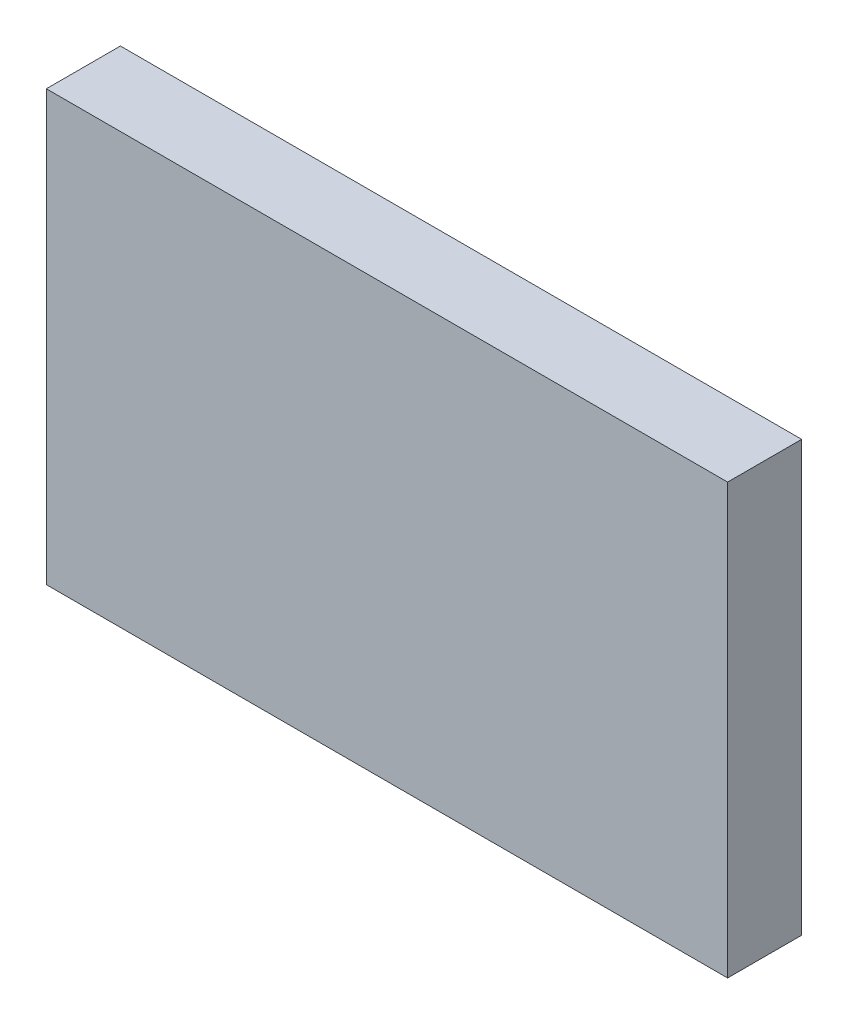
ISO-10303-21;
HEADER;
FILE_DESCRIPTION(('STEP AP214'),'2;1');
FILE_NAME('part.step','',(''),(''),'','','');
FILE_SCHEMA(('AUTOMOTIVE_DESIGN { 1 0 10303 214 1 1 1 1 }'));
ENDSEC;
DATA;
#1=APPLICATION_CONTEXT('core data for automotive mechanical design processes');
#2=APPLICATION_PROTOCOL_DEFINITION('international standard','automotive_design',2000,#1);
#3=PRODUCT_CONTEXT('',#1,'mechanical');
#4=PRODUCT('Part','Part','',(#3));
#5=PRODUCT_RELATED_PRODUCT_CATEGORY('part','',(#4));
#6=PRODUCT_DEFINITION_FORMATION('','',#4);
#7=PRODUCT_DEFINITION_CONTEXT('part definition',#1,'design');
#8=PRODUCT_DEFINITION('design','',#6,#7);
#9=PRODUCT_DEFINITION_SHAPE('','',#8);
#10=(LENGTH_UNIT() NAMED_UNIT(*) SI_UNIT(.MILLI.,.METRE.));
#11=(NAMED_UNIT(*) PLANE_ANGLE_UNIT() SI_UNIT($,.RADIAN.));
#12=(NAMED_UNIT(*) SI_UNIT($,.STERADIAN.) SOLID_ANGLE_UNIT());
#13=UNCERTAINTY_MEASURE_WITH_UNIT(LENGTH_MEASURE(1.E-05),#10,'distance_accuracy_value','');
#14=(GEOMETRIC_REPRESENTATION_CONTEXT(3) GLOBAL_UNCERTAINTY_ASSIGNED_CONTEXT((#13)) GLOBAL_UNIT_ASSIGNED_CONTEXT((#10,
#11,#12)) REPRESENTATION_CONTEXT('',''));
#15=CARTESIAN_POINT('',(0.,0.,0.));
#16=DIRECTION('',(0.,0.,1.));
#17=DIRECTION('',(1.,0.,0.));
#18=AXIS2_PLACEMENT_3D('',#15,#16,#17);
#19=CARTESIAN_POINT('',(-115.,-72.5,25.));
#20=DIRECTION('',(0.,1.,0.));
#21=DIRECTION('',(0.,0.,1.));
#22=AXIS2_PLACEMENT_3D('',#19,#20,#21);
#23=PLANE('',#22);
#24=DIRECTION('',(1.,0.,0.));
#25=VECTOR('',#24,1.);
#26=CARTESIAN_POINT('',(-115.,-72.5,0.));
#27=LINE('',#26,#25);
#28=CARTESIAN_POINT('',(-115.,-72.5,0.));
#29=VERTEX_POINT('',#28);
#30=CARTESIAN_POINT('',(115.,-72.5,0.));
#31=VERTEX_POINT('',#30);
#32=EDGE_CURVE('E108',#29,#31,#27,.T.);
#33=ORIENTED_EDGE('',*,*,#32,.T.);
#34=DIRECTION('',(0.,0.,-1.));
#35=VECTOR('',#34,1.);
#36=CARTESIAN_POINT('',(115.,-72.5,25.));
#37=LINE('',#36,#35);
#38=CARTESIAN_POINT('',(115.,-72.5,25.));
#39=VERTEX_POINT('',#38);
#40=EDGE_CURVE('E12',#39,#31,#37,.T.);
#41=ORIENTED_EDGE('',*,*,#40,.F.);
#42=DIRECTION('',(1.,0.,0.));
#43=VECTOR('',#42,1.);
#44=CARTESIAN_POINT('',(-115.,-72.5,25.));
#45=LINE('',#44,#43);
#46=CARTESIAN_POINT('',(-115.,-72.5,25.));
#47=VERTEX_POINT('',#46);
#48=EDGE_CURVE('E94',#47,#39,#45,.T.);
#49=ORIENTED_EDGE('',*,*,#48,.F.);
#50=DIRECTION('',(0.,0.,-1.));
#51=VECTOR('',#50,1.);
#52=CARTESIAN_POINT('',(-115.,-72.5,25.));
#53=LINE('',#52,#51);
#54=EDGE_CURVE('E61',#47,#29,#53,.T.);
#55=ORIENTED_EDGE('',*,*,#54,.T.);
#56=EDGE_LOOP('',(#33,#41,#49,#55));
#57=FACE_BOUND('',#56,.T.);
#58=ADVANCED_FACE('F45',(#57),#23,.F.);
#59=CARTESIAN_POINT('',(115.,-72.5,25.));
#60=DIRECTION('',(-1.,0.,0.));
#61=DIRECTION('',(0.,0.,1.));
#62=AXIS2_PLACEMENT_3D('',#59,#60,#61);
#63=PLANE('',#62);
#64=DIRECTION('',(0.,1.,0.));
#65=VECTOR('',#64,1.);
#66=CARTESIAN_POINT('',(115.,-72.5,0.));
#67=LINE('',#66,#65);
#68=CARTESIAN_POINT('',(115.,72.5,0.));
#69=VERTEX_POINT('',#68);
#70=EDGE_CURVE('E99',#31,#69,#67,.T.);
#71=ORIENTED_EDGE('',*,*,#70,.T.);
#72=DIRECTION('',(0.,0.,-1.));
#73=VECTOR('',#72,1.);
#74=CARTESIAN_POINT('',(115.,72.5,25.));
#75=LINE('',#74,#73);
#76=CARTESIAN_POINT('',(115.,72.5,25.));
#77=VERTEX_POINT('',#76);
#78=EDGE_CURVE('E53',#77,#69,#75,.T.);
#79=ORIENTED_EDGE('',*,*,#78,.F.);
#80=DIRECTION('',(0.,1.,0.));
#81=VECTOR('',#80,1.);
#82=CARTESIAN_POINT('',(115.,-72.5,25.));
#83=LINE('',#82,#81);
#84=EDGE_CURVE('E86',#39,#77,#83,.T.);
#85=ORIENTED_EDGE('',*,*,#84,.F.);
#86=ORIENTED_EDGE('',*,*,#40,.T.);
#87=EDGE_LOOP('',(#71,#79,#85,#86));
#88=FACE_BOUND('',#87,.T.);
#89=ADVANCED_FACE('F98',(#88),#63,.F.);
#90=CARTESIAN_POINT('',(-115.,72.5,25.));
#91=DIRECTION('',(0.,1.,0.));
#92=DIRECTION('',(0.,0.,1.));
#93=AXIS2_PLACEMENT_3D('',#90,#91,#92);
#94=PLANE('',#93);
#95=DIRECTION('',(1.,0.,0.));
#96=VECTOR('',#95,1.);
#97=CARTESIAN_POINT('',(-115.,72.5,0.));
#98=LINE('',#97,#96);
#99=CARTESIAN_POINT('',(-115.,72.5,0.));
#100=VERTEX_POINT('',#99);
#101=EDGE_CURVE('E111',#100,#69,#98,.T.);
#102=ORIENTED_EDGE('',*,*,#101,.F.);
#103=DIRECTION('',(0.,0.,-1.));
#104=VECTOR('',#103,1.);
#105=CARTESIAN_POINT('',(-115.,72.5,25.));
#106=LINE('',#105,#104);
#107=CARTESIAN_POINT('',(-115.,72.5,25.));
#108=VERTEX_POINT('',#107);
#109=EDGE_CURVE('E75',#108,#100,#106,.T.);
#110=ORIENTED_EDGE('',*,*,#109,.F.);
#111=DIRECTION('',(1.,0.,0.));
#112=VECTOR('',#111,1.);
#113=CARTESIAN_POINT('',(-115.,72.5,25.));
#114=LINE('',#113,#112);
#115=EDGE_CURVE('E93',#108,#77,#114,.T.);
#116=ORIENTED_EDGE('',*,*,#115,.T.);
#117=ORIENTED_EDGE('',*,*,#78,.T.);
#118=EDGE_LOOP('',(#102,#110,#116,#117));
#119=FACE_BOUND('',#118,.T.);
#120=ADVANCED_FACE('F102',(#119),#94,.T.);
#121=CARTESIAN_POINT('',(-115.,-72.5,25.));
#122=DIRECTION('',(-1.,0.,0.));
#123=DIRECTION('',(0.,0.,1.));
#124=AXIS2_PLACEMENT_3D('',#121,#122,#123);
#125=PLANE('',#124);
#126=DIRECTION('',(0.,1.,0.));
#127=VECTOR('',#126,1.);
#128=CARTESIAN_POINT('',(-115.,-72.5,0.));
#129=LINE('',#128,#127);
#130=EDGE_CURVE('E113',#29,#100,#129,.T.);
#131=ORIENTED_EDGE('',*,*,#130,.F.);
#132=ORIENTED_EDGE('',*,*,#54,.F.);
#133=DIRECTION('',(0.,1.,0.));
#134=VECTOR('',#133,1.);
#135=CARTESIAN_POINT('',(-115.,-72.5,25.));
#136=LINE('',#135,#134);
#137=EDGE_CURVE('E103',#47,#108,#136,.T.);
#138=ORIENTED_EDGE('',*,*,#137,.T.);
#139=ORIENTED_EDGE('',*,*,#109,.T.);
#140=EDGE_LOOP('',(#131,#132,#138,#139));
#141=FACE_BOUND('',#140,.T.);
#142=ADVANCED_FACE('F119',(#141),#125,.T.);
#143=CARTESIAN_POINT('',(0.,0.,25.));
#144=DIRECTION('',(0.,0.,1.));
#145=DIRECTION('',(1.,0.,0.));
#146=AXIS2_PLACEMENT_3D('',#143,#144,#145);
#147=PLANE('',#146);
#148=ORIENTED_EDGE('',*,*,#48,.T.);
#149=ORIENTED_EDGE('',*,*,#84,.T.);
#150=ORIENTED_EDGE('',*,*,#115,.F.);
#151=ORIENTED_EDGE('',*,*,#137,.F.);
#152=EDGE_LOOP('',(#148,#149,#150,#151));
#153=FACE_BOUND('',#152,.T.);
#154=ADVANCED_FACE('F90',(#153),#147,.T.);
#155=CARTESIAN_POINT('',(0.,0.,0.));
#156=DIRECTION('',(0.,0.,1.));
#157=DIRECTION('',(1.,0.,0.));
#158=AXIS2_PLACEMENT_3D('',#155,#156,#157);
#159=PLANE('',#158);
#160=ORIENTED_EDGE('',*,*,#32,.F.);
#161=ORIENTED_EDGE('',*,*,#130,.T.);
#162=ORIENTED_EDGE('',*,*,#101,.T.);
#163=ORIENTED_EDGE('',*,*,#70,.F.);
#164=EDGE_LOOP('',(#160,#161,#162,#163));
#165=FACE_BOUND('',#164,.T.);
#166=ADVANCED_FACE('F118',(#165),#159,.F.);
#167=CLOSED_SHELL('',(#58,#89,#120,#142,#154,#166));
#168=MANIFOLD_SOLID_BREP('B2',#167);
#169=CARTESIAN_POINT('',(-115.,-72.5,19.8));
#170=DIRECTION('',(0.,1.,0.));
#171=DIRECTION('',(0.,0.,1.));
#172=AXIS2_PLACEMENT_3D('',#169,#170,#171);
#173=PLANE('',#172);
#174=DIRECTION('',(1.,0.,0.));
#175=VECTOR('',#174,1.);
#176=CARTESIAN_POINT('',(-115.,-72.5,0.));
#177=LINE('',#176,#175);
#178=CARTESIAN_POINT('',(-115.,-72.5,0.));
#179=VERTEX_POINT('',#178);
#180=CARTESIAN_POINT('',(115.,-72.5,0.));
#181=VERTEX_POINT('',#180);
#182=EDGE_CURVE('E232',#179,#181,#177,.T.);
#183=ORIENTED_EDGE('',*,*,#182,.T.);
#184=DIRECTION('',(0.,0.,-1.));
#185=VECTOR('',#184,1.);
#186=CARTESIAN_POINT('',(115.,-72.5,19.8));
#187=LINE('',#186,#185);
#188=CARTESIAN_POINT('',(115.,-72.5,19.8));
#189=VERTEX_POINT('',#188);
#190=EDGE_CURVE('E43',#189,#181,#187,.T.);
#191=ORIENTED_EDGE('',*,*,#190,.F.);
#192=DIRECTION('',(1.,0.,0.));
#193=VECTOR('',#192,1.);
#194=CARTESIAN_POINT('',(-115.,-72.5,19.8));
#195=LINE('',#194,#193);
#196=CARTESIAN_POINT('',(-115.,-72.5,19.8));
#197=VERTEX_POINT('',#196);
#198=EDGE_CURVE('E218',#197,#189,#195,.T.);
#199=ORIENTED_EDGE('',*,*,#198,.F.);
#200=DIRECTION('',(0.,0.,-1.));
#201=VECTOR('',#200,1.);
#202=CARTESIAN_POINT('',(-115.,-72.5,19.8));
#203=LINE('',#202,#201);
#204=EDGE_CURVE('E185',#197,#179,#203,.T.);
#205=ORIENTED_EDGE('',*,*,#204,.T.);
#206=EDGE_LOOP('',(#183,#191,#199,#205));
#207=FACE_BOUND('',#206,.T.);
#208=ADVANCED_FACE('F169',(#207),#173,.F.);
#209=CARTESIAN_POINT('',(115.,-72.5,19.8));
#210=DIRECTION('',(-1.,0.,0.));
#211=DIRECTION('',(0.,0.,1.));
#212=AXIS2_PLACEMENT_3D('',#209,#210,#211);
#213=PLANE('',#212);
#214=DIRECTION('',(0.,1.,0.));
#215=VECTOR('',#214,1.);
#216=CARTESIAN_POINT('',(115.,-72.5,0.));
#217=LINE('',#216,#215);
#218=CARTESIAN_POINT('',(115.,72.5,0.));
#219=VERTEX_POINT('',#218);
#220=EDGE_CURVE('E223',#181,#219,#217,.T.);
#221=ORIENTED_EDGE('',*,*,#220,.T.);
#222=DIRECTION('',(0.,0.,-1.));
#223=VECTOR('',#222,1.);
#224=CARTESIAN_POINT('',(115.,72.5,19.8));
#225=LINE('',#224,#223);
#226=CARTESIAN_POINT('',(115.,72.5,19.8));
#227=VERTEX_POINT('',#226);
#228=EDGE_CURVE('E177',#227,#219,#225,.T.);
#229=ORIENTED_EDGE('',*,*,#228,.F.);
#230=DIRECTION('',(0.,1.,0.));
#231=VECTOR('',#230,1.);
#232=CARTESIAN_POINT('',(115.,-72.5,19.8));
#233=LINE('',#232,#231);
#234=EDGE_CURVE('E210',#189,#227,#233,.T.);
#235=ORIENTED_EDGE('',*,*,#234,.F.);
#236=ORIENTED_EDGE('',*,*,#190,.T.);
#237=EDGE_LOOP('',(#221,#229,#235,#236));
#238=FACE_BOUND('',#237,.T.);
#239=ADVANCED_FACE('F222',(#238),#213,.F.);
#240=CARTESIAN_POINT('',(-115.,72.5,19.8));
#241=DIRECTION('',(0.,1.,0.));
#242=DIRECTION('',(0.,0.,1.));
#243=AXIS2_PLACEMENT_3D('',#240,#241,#242);
#244=PLANE('',#243);
#245=DIRECTION('',(1.,0.,0.));
#246=VECTOR('',#245,1.);
#247=CARTESIAN_POINT('',(-115.,72.5,0.));
#248=LINE('',#247,#246);
#249=CARTESIAN_POINT('',(-115.,72.5,0.));
#250=VERTEX_POINT('',#249);
#251=EDGE_CURVE('E235',#250,#219,#248,.T.);
#252=ORIENTED_EDGE('',*,*,#251,.F.);
#253=DIRECTION('',(0.,0.,-1.));
#254=VECTOR('',#253,1.);
#255=CARTESIAN_POINT('',(-115.,72.5,19.8));
#256=LINE('',#255,#254);
#257=CARTESIAN_POINT('',(-115.,72.5,19.8));
#258=VERTEX_POINT('',#257);
#259=EDGE_CURVE('E199',#258,#250,#256,.T.);
#260=ORIENTED_EDGE('',*,*,#259,.F.);
#261=DIRECTION('',(1.,0.,0.));
#262=VECTOR('',#261,1.);
#263=CARTESIAN_POINT('',(-115.,72.5,19.8));
#264=LINE('',#263,#262);
#265=EDGE_CURVE('E217',#258,#227,#264,.T.);
#266=ORIENTED_EDGE('',*,*,#265,.T.);
#267=ORIENTED_EDGE('',*,*,#228,.T.);
#268=EDGE_LOOP('',(#252,#260,#266,#267));
#269=FACE_BOUND('',#268,.T.);
#270=ADVANCED_FACE('F226',(#269),#244,.T.);
#271=CARTESIAN_POINT('',(-115.,-72.5,19.8));
#272=DIRECTION('',(-1.,0.,0.));
#273=DIRECTION('',(0.,0.,1.));
#274=AXIS2_PLACEMENT_3D('',#271,#272,#273);
#275=PLANE('',#274);
#276=DIRECTION('',(0.,1.,0.));
#277=VECTOR('',#276,1.);
#278=CARTESIAN_POINT('',(-115.,-72.5,0.));
#279=LINE('',#278,#277);
#280=EDGE_CURVE('E237',#179,#250,#279,.T.);
#281=ORIENTED_EDGE('',*,*,#280,.F.);
#282=ORIENTED_EDGE('',*,*,#204,.F.);
#283=DIRECTION('',(0.,1.,0.));
#284=VECTOR('',#283,1.);
#285=CARTESIAN_POINT('',(-115.,-72.5,19.8));
#286=LINE('',#285,#284);
#287=EDGE_CURVE('E227',#197,#258,#286,.T.);
#288=ORIENTED_EDGE('',*,*,#287,.T.);
#289=ORIENTED_EDGE('',*,*,#259,.T.);
#290=EDGE_LOOP('',(#281,#282,#288,#289));
#291=FACE_BOUND('',#290,.T.);
#292=ADVANCED_FACE('F243',(#291),#275,.T.);
#293=CARTESIAN_POINT('',(0.,0.,19.8));
#294=DIRECTION('',(0.,0.,1.));
#295=DIRECTION('',(1.,0.,0.));
#296=AXIS2_PLACEMENT_3D('',#293,#294,#295);
#297=PLANE('',#296);
#298=ORIENTED_EDGE('',*,*,#198,.T.);
#299=ORIENTED_EDGE('',*,*,#234,.T.);
#300=ORIENTED_EDGE('',*,*,#265,.F.);
#301=ORIENTED_EDGE('',*,*,#287,.F.);
#302=EDGE_LOOP('',(#298,#299,#300,#301));
#303=FACE_BOUND('',#302,.T.);
#304=ADVANCED_FACE('F214',(#303),#297,.T.);
#305=CARTESIAN_POINT('',(0.,0.,0.));
#306=DIRECTION('',(0.,0.,1.));
#307=DIRECTION('',(1.,0.,0.));
#308=AXIS2_PLACEMENT_3D('',#305,#306,#307);
#309=PLANE('',#308);
#310=ORIENTED_EDGE('',*,*,#182,.F.);
#311=ORIENTED_EDGE('',*,*,#280,.T.);
#312=ORIENTED_EDGE('',*,*,#251,.T.);
#313=ORIENTED_EDGE('',*,*,#220,.F.);
#314=EDGE_LOOP('',(#310,#311,#312,#313));
#315=FACE_BOUND('',#314,.T.);
#316=ADVANCED_FACE('F242',(#315),#309,.F.);
#317=CLOSED_SHELL('',(#208,#239,#270,#292,#304,#316));
#318=MANIFOLD_SOLID_BREP('B6_NOT_SHOWN',#317);
#319=ADVANCED_BREP_SHAPE_REPRESENTATION('',(#18,#168,#318),#14);
#320=SHAPE_DEFINITION_REPRESENTATION(#9,#319);
ENDSEC;
END-ISO-10303-21;
